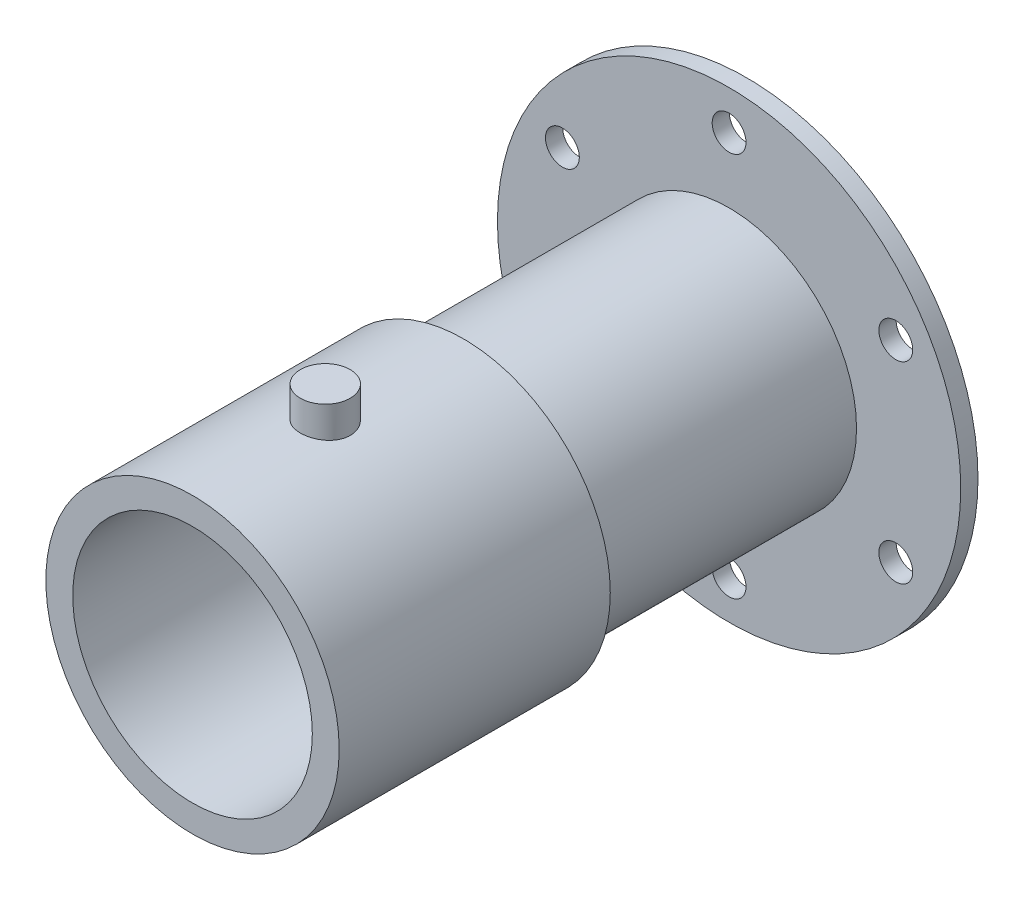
from build123d import *

# Parameters (mm, degrees)
SKETCH1_R                  = 44.323
EXTRUDE1_DEPTH             = 3.302
SKETCH9_R                  = 24.384
EXTRUDE4_DEPTH             = 50.8
SKETCH10_R                 = 28.067
EXTRUDE5_DEPTH             = 51.8668
SKETCH11_R                 = 22.9235
CUT_EXTRUDE4_DEPTH         = 44.45
SKETCH8_R                  = 3.2385
CUT_EXTRUDE3_DEPTH         = 121.289353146
CIRPATTERN2_COUNT          = 6
EXTRUDE6_REACH             = 137.773
EXTRUDE6_END_RADIUS        = 28.067
SKETCH12_R                 = 4.7625
EXTRUDE6_DIRECTION_2_DEPTH = 5.7658


with BuildPart() as part:
    # Sketch1 → Extrude1 (new body)
    with BuildSketch(Plane.XY):
        with Locations(Location((0, 0, 0), (0, 0, 180))):
            Circle(SKETCH1_R)
    extrude(amount=EXTRUDE1_DEPTH)

    # Sketch9 → Extrude4 (add)
    with BuildSketch(Plane.XY.offset(3.302)):
        Circle(SKETCH9_R)
    extrude(amount=EXTRUDE4_DEPTH)

    # Sketch10 → Extrude5 (add)
    with BuildSketch(Plane.XY.offset(54.102)):
        Circle(SKETCH10_R)
    extrude(amount=EXTRUDE5_DEPTH)

    # Sketch11 → Cut-Extrude4 (cut)
    with BuildSketch(Plane.XY.offset(105.9688)):
        Circle(SKETCH11_R)
    extrude(amount=-CUT_EXTRUDE4_DEPTH, mode=Mode.SUBTRACT)

    # Sketch8 → Cut-Extrude3 (cut, through all)
    with BuildSketch(Plane.XY.offset(3.302)):
        with Locations((0, 36.83)):
            Circle(SKETCH8_R)
    cut_extrude3 = extrude(amount=-CUT_EXTRUDE3_DEPTH, mode=Mode.SUBTRACT)

    # CirPattern2: Cut-Extrude3 ×6 about axis
    cirpattern2_axis = Axis((0, 0, 0), (0, 0, 1))
    for i in range(1, CIRPATTERN2_COUNT):
        add(cut_extrude3.rotate(cirpattern2_axis, i * 360 / CIRPATTERN2_COUNT), mode=Mode.SUBTRACT)

    # Extrude6: up to this cylinder (the profile starts outside it)
    extrude6_end = Plane(origin=(0, 0, 80.5688), z_dir=(0, 0, -1)) * Cylinder(EXTRUDE6_END_RADIUS, 332.68, mode=Mode.PRIVATE)
    # Sketch12 → Extrude6 (add, up to the surface)
    with BuildSketch(Plane(origin=(0, 28.067, 0), x_dir=(-1, 0, 0), z_dir=(0, 1, 0)), mode=Mode.PRIVATE) as extrude6_sk1:
        with Locations(Location((0, 80.5688, 0), (0, 0, 90))):
            Circle(SKETCH12_R)
    extrude6_tool1 = extrude(extrude6_sk1.sketch, amount=-EXTRUDE6_REACH, mode=Mode.PRIVATE) - extrude6_end
    add(extrude6_tool1.solids().sort_by_distance((0, 28.067, 80.5688))[0])
    add(extrude6_tool1.solids().sort_by_distance((0, 28.067, 80.5688))[1])

    # Sketch12 → Extrude6 direction 2 (add)
    with BuildSketch(Plane(origin=(0, 28.067, 0), x_dir=(-1, 0, 0), z_dir=(0, 1, 0))):
        with Locations(Location((0, 80.5688, 0), (0, 0, 90))):
            Circle(SKETCH12_R)
    extrude(amount=EXTRUDE6_DIRECTION_2_DEPTH)


solid = part.part
